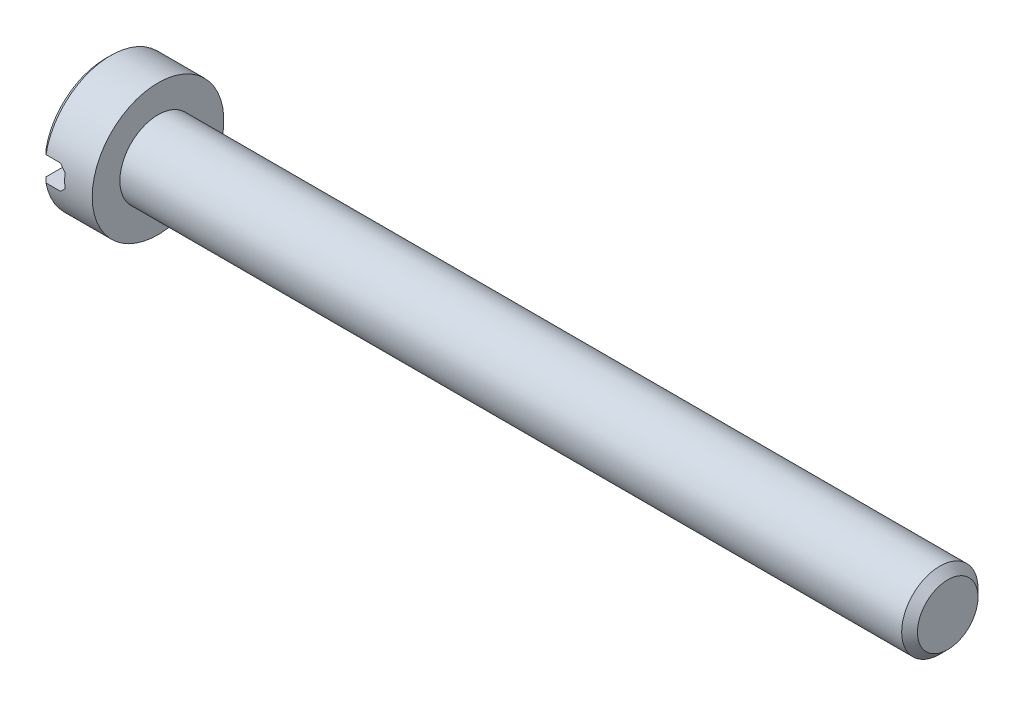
ISO-10303-21;
HEADER;
FILE_DESCRIPTION(('STEP AP214'),'2;1');
FILE_NAME('part.step','',(''),(''),'','','');
FILE_SCHEMA(('AUTOMOTIVE_DESIGN { 1 0 10303 214 1 1 1 1 }'));
ENDSEC;
DATA;
#1=APPLICATION_CONTEXT('core data for automotive mechanical design processes');
#2=APPLICATION_PROTOCOL_DEFINITION('international standard','automotive_design',2000,#1);
#3=PRODUCT_CONTEXT('',#1,'mechanical');
#4=PRODUCT('Part','Part','',(#3));
#5=PRODUCT_RELATED_PRODUCT_CATEGORY('part','',(#4));
#6=PRODUCT_DEFINITION_FORMATION('','',#4);
#7=PRODUCT_DEFINITION_CONTEXT('part definition',#1,'design');
#8=PRODUCT_DEFINITION('design','',#6,#7);
#9=PRODUCT_DEFINITION_SHAPE('','',#8);
#10=(LENGTH_UNIT() NAMED_UNIT(*) SI_UNIT(.MILLI.,.METRE.));
#11=(NAMED_UNIT(*) PLANE_ANGLE_UNIT() SI_UNIT($,.RADIAN.));
#12=(NAMED_UNIT(*) SI_UNIT($,.STERADIAN.) SOLID_ANGLE_UNIT());
#13=UNCERTAINTY_MEASURE_WITH_UNIT(LENGTH_MEASURE(1.E-05),#10,'distance_accuracy_value','');
#14=(GEOMETRIC_REPRESENTATION_CONTEXT(3) GLOBAL_UNCERTAINTY_ASSIGNED_CONTEXT((#13)) GLOBAL_UNIT_ASSIGNED_CONTEXT((#10,
#11,#12)) REPRESENTATION_CONTEXT('',''));
#15=CARTESIAN_POINT('',(0.,0.,0.));
#16=DIRECTION('',(0.,0.,1.));
#17=DIRECTION('',(1.,0.,0.));
#18=AXIS2_PLACEMENT_3D('',#15,#16,#17);
#19=CARTESIAN_POINT('',(2.,2.5,0.));
#20=DIRECTION('',(-1.,0.,0.));
#21=DIRECTION('',(0.,0.,1.));
#22=AXIS2_PLACEMENT_3D('',#19,#20,#21);
#23=PLANE('',#22);
#24=CARTESIAN_POINT('',(2.,0.,0.));
#25=DIRECTION('',(-1.,0.,0.));
#26=DIRECTION('',(0.,0.,1.));
#27=AXIS2_PLACEMENT_3D('',#24,#25,#26);
#28=CIRCLE('',#27,2.5);
#29=CARTESIAN_POINT('',(2.,0.,2.5));
#30=VERTEX_POINT('',#29);
#31=EDGE_CURVE('E195',#30,#30,#28,.T.);
#32=ORIENTED_EDGE('',*,*,#31,.F.);
#33=EDGE_LOOP('',(#32));
#34=FACE_BOUND('',#33,.T.);
#35=CARTESIAN_POINT('',(2.,0.,0.));
#36=DIRECTION('',(-1.,0.,0.));
#37=DIRECTION('',(0.,0.,1.));
#38=AXIS2_PLACEMENT_3D('',#35,#36,#37);
#39=CIRCLE('',#38,1.45);
#40=CARTESIAN_POINT('',(2.,0.,1.45));
#41=VERTEX_POINT('',#40);
#42=EDGE_CURVE('E147',#41,#41,#39,.F.);
#43=ORIENTED_EDGE('',*,*,#42,.F.);
#44=EDGE_LOOP('',(#43));
#45=FACE_BOUND('',#44,.T.);
#46=ADVANCED_FACE('F34',(#34,#45),#23,.F.);
#47=CARTESIAN_POINT('',(0.,0.,0.));
#48=DIRECTION('',(1.,0.,0.));
#49=DIRECTION('',(0.,0.,-1.));
#50=AXIS2_PLACEMENT_3D('',#47,#48,#49);
#51=PLANE('',#50);
#52=CARTESIAN_POINT('',(0.,0.,0.));
#53=DIRECTION('',(-1.,0.,0.));
#54=DIRECTION('',(0.,0.,1.));
#55=AXIS2_PLACEMENT_3D('',#52,#53,#54);
#56=CIRCLE('',#55,2.3);
#57=CARTESIAN_POINT('',(0.,0.465549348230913,2.25239068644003));
#58=VERTEX_POINT('',#57);
#59=CARTESIAN_POINT('',(0.,0.465549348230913,-2.25239068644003));
#60=VERTEX_POINT('',#59);
#61=EDGE_CURVE('E117',#58,#60,#56,.T.);
#62=ORIENTED_EDGE('',*,*,#61,.T.);
#63=DIRECTION('',(0.,0.,1.));
#64=VECTOR('',#63,1.);
#65=CARTESIAN_POINT('',(0.,0.465549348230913,-5.));
#66=LINE('',#65,#64);
#67=EDGE_CURVE('E109',#60,#58,#66,.T.);
#68=ORIENTED_EDGE('',*,*,#67,.T.);
#69=EDGE_LOOP('',(#62,#68));
#70=FACE_BOUND('',#69,.T.);
#71=ADVANCED_FACE('F163',(#70),#51,.F.);
#72=CARTESIAN_POINT('',(0.2,0.,0.));
#73=DIRECTION('',(1.,0.,0.));
#74=DIRECTION('',(0.,0.,-1.));
#75=AXIS2_PLACEMENT_3D('',#72,#73,#74);
#76=CONICAL_SURFACE('',#75,2.5,0.785398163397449);
#77=CARTESIAN_POINT('',(0.2,0.,0.));
#78=DIRECTION('',(-1.,0.,0.));
#79=DIRECTION('',(0.,0.,1.));
#80=AXIS2_PLACEMENT_3D('',#77,#78,#79);
#81=CIRCLE('',#80,2.5);
#82=CARTESIAN_POINT('',(0.2,0.465549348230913,2.45627030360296));
#83=VERTEX_POINT('',#82);
#84=CARTESIAN_POINT('',(0.2,0.465549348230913,-2.45627030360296));
#85=VERTEX_POINT('',#84);
#86=EDGE_CURVE('E118',#83,#85,#81,.T.);
#87=ORIENTED_EDGE('',*,*,#86,.T.);
#88=CARTESIAN_POINT('',(3.20259904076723,0.465549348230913,-5.48286968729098));
#89=CARTESIAN_POINT('',(3.00738145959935,0.465549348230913,-5.28694329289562));
#90=CARTESIAN_POINT('',(2.81219546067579,0.465549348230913,-5.09098538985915));
#91=CARTESIAN_POINT('',(2.42191937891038,0.465549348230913,-4.69895178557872));
#92=CARTESIAN_POINT('',(2.22682930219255,0.465549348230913,-4.50287607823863));
#93=CARTESIAN_POINT('',(1.83653240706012,0.465549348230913,-4.11030517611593));
#94=CARTESIAN_POINT('',(1.64132579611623,0.465549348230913,-3.9138097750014));
#95=CARTESIAN_POINT('',(1.25115924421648,0.465549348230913,-3.52059587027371));
#96=CARTESIAN_POINT('',(1.05619929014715,0.465549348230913,-3.32387737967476));
#97=CARTESIAN_POINT('',(0.678173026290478,0.465549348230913,-2.9416895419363));
#98=CARTESIAN_POINT('',(0.495084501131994,0.465549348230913,-2.7562421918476));
#99=CARTESIAN_POINT('',(0.220902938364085,0.465549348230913,-2.47759625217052));
#100=CARTESIAN_POINT('',(0.129576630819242,0.465549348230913,-2.38462728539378));
#101=CARTESIAN_POINT('',(-0.0528521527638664,0.465549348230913,-2.19847287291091));
#102=CARTESIAN_POINT('',(-0.143954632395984,0.465549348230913,-2.10528743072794));
#103=CARTESIAN_POINT('',(-0.325762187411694,0.465549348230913,-1.91867757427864));
#104=CARTESIAN_POINT('',(-0.416467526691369,0.465549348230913,-1.82525341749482));
#105=CARTESIAN_POINT('',(-0.597381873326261,0.465549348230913,-1.63791440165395));
#106=CARTESIAN_POINT('',(-0.687590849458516,0.465549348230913,-1.54399951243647));
#107=CARTESIAN_POINT('',(-0.867162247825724,0.465549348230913,-1.3554114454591));
#108=CARTESIAN_POINT('',(-0.956524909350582,0.465549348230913,-1.26073849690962));
#109=CARTESIAN_POINT('',(-1.08939468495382,0.465549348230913,-1.11764625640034));
#110=CARTESIAN_POINT('',(-1.1334867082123,0.465549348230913,-1.06977082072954));
#111=CARTESIAN_POINT('',(-1.2210969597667,0.465549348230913,-0.973498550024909));
#112=CARTESIAN_POINT('',(-1.26461520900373,0.465549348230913,-0.925101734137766));
#113=CARTESIAN_POINT('',(-1.3317610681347,0.465549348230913,-0.849065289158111));
#114=CARTESIAN_POINT('',(-1.35569012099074,0.465549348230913,-0.821692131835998));
#115=CARTESIAN_POINT('',(-1.40319102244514,0.465549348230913,-0.766632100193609));
#116=CARTESIAN_POINT('',(-1.42676283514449,0.465549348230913,-0.73894519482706));
#117=CARTESIAN_POINT('',(-1.47366376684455,0.465549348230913,-0.682886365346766));
#118=CARTESIAN_POINT('',(-1.49698800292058,0.465549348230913,-0.654510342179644));
#119=CARTESIAN_POINT('',(-1.54295549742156,0.465549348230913,-0.597221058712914));
#120=CARTESIAN_POINT('',(-1.56559892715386,0.465549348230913,-0.568307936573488));
#121=CARTESIAN_POINT('',(-1.61016736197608,0.465549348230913,-0.509419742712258));
#122=CARTESIAN_POINT('',(-1.63208156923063,0.465549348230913,-0.479436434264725));
#123=CARTESIAN_POINT('',(-1.67445976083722,0.465549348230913,-0.418389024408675));
#124=CARTESIAN_POINT('',(-1.69492180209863,0.465549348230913,-0.387323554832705));
#125=CARTESIAN_POINT('',(-1.73332185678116,0.465549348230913,-0.324061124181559));
#126=CARTESIAN_POINT('',(-1.75128287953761,0.465549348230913,-0.291878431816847));
#127=CARTESIAN_POINT('',(-1.78342369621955,0.465549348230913,-0.225717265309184));
#128=CARTESIAN_POINT('',(-1.79761500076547,0.465549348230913,-0.191744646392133));
#129=CARTESIAN_POINT('',(-1.81895609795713,0.465549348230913,-0.124795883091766));
#130=CARTESIAN_POINT('',(-1.8266128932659,0.465549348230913,-0.0919921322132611));
#131=CARTESIAN_POINT('',(-1.83488894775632,0.465549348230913,-0.0256267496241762));
#132=CARTESIAN_POINT('',(-1.83554895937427,0.465549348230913,0.00792935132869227));
#133=CARTESIAN_POINT('',(-1.82973306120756,0.465549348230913,0.0742464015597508));
#134=CARTESIAN_POINT('',(-1.82328333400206,0.465549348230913,0.107009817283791));
#135=CARTESIAN_POINT('',(-1.80956338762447,0.465549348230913,0.155027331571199));
#136=CARTESIAN_POINT('',(-1.80428518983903,0.465549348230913,0.170909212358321));
#137=CARTESIAN_POINT('',(-1.79261948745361,0.465549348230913,0.202260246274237));
#138=CARTESIAN_POINT('',(-1.78623214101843,0.465549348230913,0.217729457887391));
#139=CARTESIAN_POINT('',(-1.76761840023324,0.465549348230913,0.259328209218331));
#140=CARTESIAN_POINT('',(-1.7545143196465,0.465549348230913,0.285061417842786));
#141=CARTESIAN_POINT('',(-1.72651469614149,0.465549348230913,0.335544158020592));
#142=CARTESIAN_POINT('',(-1.71161720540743,0.465549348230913,0.360292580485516));
#143=CARTESIAN_POINT('',(-1.68054228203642,0.465549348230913,0.409079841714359));
#144=CARTESIAN_POINT('',(-1.66436078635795,0.465549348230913,0.433116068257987));
#145=CARTESIAN_POINT('',(-1.63111775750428,0.465549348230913,0.480575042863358));
#146=CARTESIAN_POINT('',(-1.61405601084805,0.465549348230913,0.503997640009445));
#147=CARTESIAN_POINT('',(-1.5616167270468,0.465549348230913,0.573971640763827));
#148=CARTESIAN_POINT('',(-1.52527399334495,0.465549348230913,0.619796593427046));
#149=CARTESIAN_POINT('',(-1.45124163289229,0.465549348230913,0.710149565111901));
#150=CARTESIAN_POINT('',(-1.41355526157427,0.465549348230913,0.7546802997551));
#151=CARTESIAN_POINT('',(-1.33810033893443,0.465549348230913,0.842013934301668));
#152=CARTESIAN_POINT('',(-1.30035092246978,0.465549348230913,0.884833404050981));
#153=CARTESIAN_POINT('',(-1.22427339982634,0.465549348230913,0.969954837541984));
#154=CARTESIAN_POINT('',(-1.18594527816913,0.465549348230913,1.01225678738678));
#155=CARTESIAN_POINT('',(-1.07035214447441,0.465549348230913,1.13862723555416));
#156=CARTESIAN_POINT('',(-0.992489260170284,0.465549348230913,1.22214795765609));
#157=CARTESIAN_POINT('',(-0.835814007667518,0.465549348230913,1.38847609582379));
#158=CARTESIAN_POINT('',(-0.757000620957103,0.465549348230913,1.47128254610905));
#159=CARTESIAN_POINT('',(-0.598849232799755,0.465549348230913,1.63637982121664));
#160=CARTESIAN_POINT('',(-0.519511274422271,0.465549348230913,1.71867068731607));
#161=CARTESIAN_POINT('',(-0.361217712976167,0.465549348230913,1.88216701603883));
#162=CARTESIAN_POINT('',(-0.282265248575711,0.465549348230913,1.9633755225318));
#163=CARTESIAN_POINT('',(-0.124123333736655,0.465549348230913,2.12556467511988));
#164=CARTESIAN_POINT('',(-0.044933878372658,0.465549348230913,2.20654531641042));
#165=CARTESIAN_POINT('',(0.192811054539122,0.465549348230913,2.44916767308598));
#166=CARTESIAN_POINT('',(0.351615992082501,0.465549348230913,2.61056482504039));
#167=CARTESIAN_POINT('',(0.732972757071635,0.465549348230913,2.99726131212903));
#168=CARTESIAN_POINT('',(0.955700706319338,0.465549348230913,3.22238674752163));
#169=CARTESIAN_POINT('',(1.401572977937,0.465549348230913,3.67230050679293));
#170=CARTESIAN_POINT('',(1.62471736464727,0.465549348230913,3.89708876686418));
#171=CARTESIAN_POINT('',(2.07358635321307,0.465549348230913,4.34881324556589));
#172=CARTESIAN_POINT('',(2.29931333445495,0.465549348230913,4.57574709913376));
#173=CARTESIAN_POINT('',(2.7508805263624,0.465549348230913,5.02942321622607));
#174=CARTESIAN_POINT('',(2.97672071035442,0.465549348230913,5.2561655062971));
#175=CARTESIAN_POINT('',(3.20259904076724,0.465549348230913,5.48286968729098));
#176=B_SPLINE_CURVE_WITH_KNOTS('',3,(#88,#89,#90,#91,#92,#93,#94,#95,#96,#97,#98,#99,#100,#101,
#102,#103,#104,#105,#106,#107,#108,#109,#110,#111,#112,#113,#114,#115,#116,#117,#118,#119,#120,
#121,#122,#123,#124,#125,#126,#127,#128,#129,#130,#131,#132,#133,#134,#135,#136,#137,#138,#139,
#140,#141,#142,#143,#144,#145,#146,#147,#148,#149,#150,#151,#152,#153,#154,#155,#156,#157,#158,
#159,#160,#161,#162,#163,#164,#165,#166,#167,#168,#169,#170,#171,#172,#173,#174,#175),
.UNSPECIFIED.,.F.,.F.,(4,2,2,2,2,2,2,2,2,2,2,2,2,2,2,2,2,2,2,2,2,2,2,2,2,2,2,2,2,2,2,2,2,2,2,2,
2,2,2,2,2,2,2,4),(0.,0.829743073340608,1.65953360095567,2.49046340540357,3.3213470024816,
4.10314469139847,4.49410926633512,4.88506752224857,5.27570632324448,5.66636942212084,
6.05691855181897,6.25217337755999,6.44742105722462,6.55649218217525,6.66557419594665,
6.77576205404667,6.88592195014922,6.99730763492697,7.10883965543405,7.21926609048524,
7.32935136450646,7.42981570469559,7.52969457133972,7.62920684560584,7.67938417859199,
7.72955436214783,7.81607261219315,7.90268569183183,7.9895847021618,8.07650488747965,
8.25190336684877,8.42690244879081,8.59814445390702,8.76939104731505,9.11193368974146,
9.45488345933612,9.79780541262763,10.1375912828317,10.4773842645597,11.1566564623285,
12.1067097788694,13.0569245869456,14.0171665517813,14.9772407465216),.UNSPECIFIED.);
#177=EDGE_CURVE('E57',#85,#60,#176,.T.);
#178=ORIENTED_EDGE('',*,*,#177,.T.);
#179=ORIENTED_EDGE('',*,*,#61,.F.);
#180=EDGE_CURVE('E189',#58,#83,#176,.T.);
#181=ORIENTED_EDGE('',*,*,#180,.T.);
#182=EDGE_LOOP('',(#87,#178,#179,#181));
#183=FACE_BOUND('',#182,.T.);
#184=ADVANCED_FACE('F169',(#183),#76,.T.);
#185=CARTESIAN_POINT('',(0.,-0.465549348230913,-2.25239068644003));
#186=VERTEX_POINT('',#185);
#187=CARTESIAN_POINT('',(0.,-0.465549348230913,2.25239068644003));
#188=VERTEX_POINT('',#187);
#189=EDGE_CURVE('E114',#186,#188,#56,.T.);
#190=ORIENTED_EDGE('',*,*,#189,.T.);
#191=DIRECTION('',(0.,0.,1.));
#192=VECTOR('',#191,1.);
#193=CARTESIAN_POINT('',(0.,-0.465549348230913,-5.));
#194=LINE('',#193,#192);
#195=EDGE_CURVE('E100',#186,#188,#194,.T.);
#196=ORIENTED_EDGE('',*,*,#195,.F.);
#197=EDGE_LOOP('',(#190,#196));
#198=FACE_BOUND('',#197,.T.);
#199=ADVANCED_FACE('F113',(#198),#51,.F.);
#200=CARTESIAN_POINT('',(0.2,-0.465549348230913,-2.45627030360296));
#201=VERTEX_POINT('',#200);
#202=CARTESIAN_POINT('',(0.2,-0.465549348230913,2.45627030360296));
#203=VERTEX_POINT('',#202);
#204=EDGE_CURVE('E122',#201,#203,#81,.T.);
#205=ORIENTED_EDGE('',*,*,#204,.T.);
#206=CARTESIAN_POINT('',(3.20259904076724,-0.465549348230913,5.48286968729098));
#207=CARTESIAN_POINT('',(3.00738145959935,-0.465549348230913,5.28694329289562));
#208=CARTESIAN_POINT('',(2.81219546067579,-0.465549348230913,5.09098538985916));
#209=CARTESIAN_POINT('',(2.42191937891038,-0.465549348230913,4.69895178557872));
#210=CARTESIAN_POINT('',(2.22682930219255,-0.465549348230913,4.50287607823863));
#211=CARTESIAN_POINT('',(1.83653240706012,-0.465549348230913,4.11030517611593));
#212=CARTESIAN_POINT('',(1.64132579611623,-0.465549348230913,3.9138097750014));
#213=CARTESIAN_POINT('',(1.25115924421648,-0.465549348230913,3.52059587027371));
#214=CARTESIAN_POINT('',(1.05619929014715,-0.465549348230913,3.32387737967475));
#215=CARTESIAN_POINT('',(0.678173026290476,-0.465549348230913,2.9416895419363));
#216=CARTESIAN_POINT('',(0.495084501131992,-0.465549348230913,2.75624219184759));
#217=CARTESIAN_POINT('',(0.220902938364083,-0.465549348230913,2.47759625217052));
#218=CARTESIAN_POINT('',(0.12957663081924,-0.465549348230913,2.38462728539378));
#219=CARTESIAN_POINT('',(-0.0528521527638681,-0.465549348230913,2.19847287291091));
#220=CARTESIAN_POINT('',(-0.143954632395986,-0.465549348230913,2.10528743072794));
#221=CARTESIAN_POINT('',(-0.325762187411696,-0.465549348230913,1.91867757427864));
#222=CARTESIAN_POINT('',(-0.41646752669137,-0.465549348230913,1.82525341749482));
#223=CARTESIAN_POINT('',(-0.597381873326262,-0.465549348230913,1.63791440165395));
#224=CARTESIAN_POINT('',(-0.687590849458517,-0.465549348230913,1.54399951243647));
#225=CARTESIAN_POINT('',(-0.867162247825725,-0.465549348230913,1.3554114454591));
#226=CARTESIAN_POINT('',(-0.956524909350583,-0.465549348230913,1.26073849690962));
#227=CARTESIAN_POINT('',(-1.08939468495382,-0.465549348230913,1.11764625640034));
#228=CARTESIAN_POINT('',(-1.1334867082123,-0.465549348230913,1.06977082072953));
#229=CARTESIAN_POINT('',(-1.2210969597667,-0.465549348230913,0.973498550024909));
#230=CARTESIAN_POINT('',(-1.26461520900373,-0.465549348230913,0.925101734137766));
#231=CARTESIAN_POINT('',(-1.33176106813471,-0.465549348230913,0.84906528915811));
#232=CARTESIAN_POINT('',(-1.35569012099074,-0.465549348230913,0.821692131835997));
#233=CARTESIAN_POINT('',(-1.40319102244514,-0.465549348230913,0.766632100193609));
#234=CARTESIAN_POINT('',(-1.42676283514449,-0.465549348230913,0.738945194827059));
#235=CARTESIAN_POINT('',(-1.47366376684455,-0.465549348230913,0.682886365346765));
#236=CARTESIAN_POINT('',(-1.49698800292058,-0.465549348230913,0.654510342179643));
#237=CARTESIAN_POINT('',(-1.54295549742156,-0.465549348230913,0.597221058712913));
#238=CARTESIAN_POINT('',(-1.56559892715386,-0.465549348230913,0.568307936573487));
#239=CARTESIAN_POINT('',(-1.61016736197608,-0.465549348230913,0.509419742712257));
#240=CARTESIAN_POINT('',(-1.63208156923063,-0.465549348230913,0.479436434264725));
#241=CARTESIAN_POINT('',(-1.67445976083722,-0.465549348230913,0.418389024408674));
#242=CARTESIAN_POINT('',(-1.69492180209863,-0.465549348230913,0.387323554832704));
#243=CARTESIAN_POINT('',(-1.73332185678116,-0.465549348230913,0.324061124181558));
#244=CARTESIAN_POINT('',(-1.75128287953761,-0.465549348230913,0.291878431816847));
#245=CARTESIAN_POINT('',(-1.78342369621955,-0.465549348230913,0.225717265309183));
#246=CARTESIAN_POINT('',(-1.79761500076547,-0.465549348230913,0.191744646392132));
#247=CARTESIAN_POINT('',(-1.81895609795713,-0.465549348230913,0.124795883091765));
#248=CARTESIAN_POINT('',(-1.8266128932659,-0.465549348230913,0.0919921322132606));
#249=CARTESIAN_POINT('',(-1.83488894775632,-0.465549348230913,0.0256267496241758));
#250=CARTESIAN_POINT('',(-1.83554895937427,-0.465549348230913,-0.00792935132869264));
#251=CARTESIAN_POINT('',(-1.82973306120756,-0.465549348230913,-0.0742464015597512));
#252=CARTESIAN_POINT('',(-1.82328333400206,-0.465549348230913,-0.107009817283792));
#253=CARTESIAN_POINT('',(-1.80956338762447,-0.465549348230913,-0.155027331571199));
#254=CARTESIAN_POINT('',(-1.80428518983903,-0.465549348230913,-0.170909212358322));
#255=CARTESIAN_POINT('',(-1.79261948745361,-0.465549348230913,-0.202260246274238));
#256=CARTESIAN_POINT('',(-1.78623214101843,-0.465549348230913,-0.217729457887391));
#257=CARTESIAN_POINT('',(-1.76761840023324,-0.465549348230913,-0.259328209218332));
#258=CARTESIAN_POINT('',(-1.7545143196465,-0.465549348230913,-0.285061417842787));
#259=CARTESIAN_POINT('',(-1.72651469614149,-0.465549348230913,-0.335544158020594));
#260=CARTESIAN_POINT('',(-1.71161720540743,-0.465549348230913,-0.360292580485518));
#261=CARTESIAN_POINT('',(-1.68054228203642,-0.465549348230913,-0.40907984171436));
#262=CARTESIAN_POINT('',(-1.66436078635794,-0.465549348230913,-0.433116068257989));
#263=CARTESIAN_POINT('',(-1.63111775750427,-0.465549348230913,-0.48057504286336));
#264=CARTESIAN_POINT('',(-1.61405601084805,-0.465549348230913,-0.503997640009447));
#265=CARTESIAN_POINT('',(-1.5616167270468,-0.465549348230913,-0.573971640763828));
#266=CARTESIAN_POINT('',(-1.52527399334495,-0.465549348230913,-0.619796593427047));
#267=CARTESIAN_POINT('',(-1.45124163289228,-0.465549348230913,-0.710149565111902));
#268=CARTESIAN_POINT('',(-1.41355526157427,-0.465549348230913,-0.754680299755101));
#269=CARTESIAN_POINT('',(-1.33810033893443,-0.465549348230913,-0.842013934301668));
#270=CARTESIAN_POINT('',(-1.30035092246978,-0.465549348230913,-0.88483340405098));
#271=CARTESIAN_POINT('',(-1.22427339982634,-0.465549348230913,-0.969954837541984));
#272=CARTESIAN_POINT('',(-1.18594527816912,-0.465549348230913,-1.01225678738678));
#273=CARTESIAN_POINT('',(-1.07035214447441,-0.465549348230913,-1.13862723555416));
#274=CARTESIAN_POINT('',(-0.992489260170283,-0.465549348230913,-1.2221479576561));
#275=CARTESIAN_POINT('',(-0.835814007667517,-0.465549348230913,-1.38847609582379));
#276=CARTESIAN_POINT('',(-0.757000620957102,-0.465549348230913,-1.47128254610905));
#277=CARTESIAN_POINT('',(-0.598849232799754,-0.465549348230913,-1.63637982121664));
#278=CARTESIAN_POINT('',(-0.51951127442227,-0.465549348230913,-1.71867068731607));
#279=CARTESIAN_POINT('',(-0.361217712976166,-0.465549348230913,-1.88216701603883));
#280=CARTESIAN_POINT('',(-0.282265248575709,-0.465549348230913,-1.9633755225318));
#281=CARTESIAN_POINT('',(-0.124123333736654,-0.465549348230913,-2.12556467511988));
#282=CARTESIAN_POINT('',(-0.0449338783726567,-0.465549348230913,-2.20654531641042));
#283=CARTESIAN_POINT('',(0.192811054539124,-0.465549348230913,-2.44916767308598));
#284=CARTESIAN_POINT('',(0.351615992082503,-0.465549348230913,-2.6105648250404));
#285=CARTESIAN_POINT('',(0.732972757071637,-0.465549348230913,-2.99726131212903));
#286=CARTESIAN_POINT('',(0.95570070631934,-0.465549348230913,-3.22238674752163));
#287=CARTESIAN_POINT('',(1.401572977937,-0.465549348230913,-3.67230050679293));
#288=CARTESIAN_POINT('',(1.62471736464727,-0.465549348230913,-3.89708876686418));
#289=CARTESIAN_POINT('',(2.07358635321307,-0.465549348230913,-4.34881324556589));
#290=CARTESIAN_POINT('',(2.29931333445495,-0.465549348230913,-4.57574709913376));
#291=CARTESIAN_POINT('',(2.75088052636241,-0.465549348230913,-5.02942321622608));
#292=CARTESIAN_POINT('',(2.97672071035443,-0.465549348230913,-5.2561655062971));
#293=CARTESIAN_POINT('',(3.20259904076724,-0.465549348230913,-5.48286968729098));
#294=B_SPLINE_CURVE_WITH_KNOTS('',3,(#206,#207,#208,#209,#210,#211,#212,#213,#214,#215,#216,
#217,#218,#219,#220,#221,#222,#223,#224,#225,#226,#227,#228,#229,#230,#231,#232,#233,#234,#235,
#236,#237,#238,#239,#240,#241,#242,#243,#244,#245,#246,#247,#248,#249,#250,#251,#252,#253,#254,
#255,#256,#257,#258,#259,#260,#261,#262,#263,#264,#265,#266,#267,#268,#269,#270,#271,#272,#273,
#274,#275,#276,#277,#278,#279,#280,#281,#282,#283,#284,#285,#286,#287,#288,#289,#290,#291,#292,
#293),.UNSPECIFIED.,.F.,.F.,(4,2,2,2,2,2,2,2,2,2,2,2,2,2,2,2,2,2,2,2,2,2,2,2,2,2,2,2,2,2,2,2,2,
2,2,2,2,2,2,2,2,2,2,4),(0.,0.82974307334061,1.65953360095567,2.49046340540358,3.32134700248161,
4.10314469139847,4.49410926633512,4.88506752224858,5.27570632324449,5.66636942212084,
6.05691855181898,6.25217337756,6.44742105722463,6.55649218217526,6.66557419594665,
6.77576205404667,6.88592195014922,6.99730763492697,7.10883965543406,7.21926609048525,
7.32935136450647,7.42981570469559,7.52969457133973,7.62920684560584,7.67938417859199,
7.72955436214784,7.81607261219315,7.90268569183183,7.98958470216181,8.07650488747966,
8.25190336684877,8.42690244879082,8.59814445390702,8.76939104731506,9.11193368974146,
9.45488345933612,9.79780541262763,10.1375912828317,10.4773842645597,11.1566564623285,
12.1067097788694,13.0569245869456,14.0171665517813,14.9772407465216),.UNSPECIFIED.);
#295=EDGE_CURVE('E108',#203,#188,#294,.T.);
#296=ORIENTED_EDGE('',*,*,#295,.T.);
#297=ORIENTED_EDGE('',*,*,#189,.F.);
#298=EDGE_CURVE('E97',#186,#201,#294,.T.);
#299=ORIENTED_EDGE('',*,*,#298,.T.);
#300=EDGE_LOOP('',(#205,#296,#297,#299));
#301=FACE_BOUND('',#300,.T.);
#302=ADVANCED_FACE('F116',(#301),#76,.T.);
#303=CARTESIAN_POINT('',(0.,0.,0.));
#304=DIRECTION('',(-1.,0.,0.));
#305=DIRECTION('',(0.,0.,1.));
#306=AXIS2_PLACEMENT_3D('',#303,#304,#305);
#307=CYLINDRICAL_SURFACE('',#306,2.5);
#308=ORIENTED_EDGE('',*,*,#86,.F.);
#309=DIRECTION('',(-1.,0.,0.));
#310=VECTOR('',#309,1.);
#311=CARTESIAN_POINT('',(0.,0.465549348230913,2.45627030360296));
#312=LINE('',#311,#310);
#313=CARTESIAN_POINT('',(0.753445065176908,0.465549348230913,2.45627030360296));
#314=VERTEX_POINT('',#313);
#315=EDGE_CURVE('E144',#83,#314,#312,.F.);
#316=ORIENTED_EDGE('',*,*,#315,.T.);
#317=CARTESIAN_POINT('',(1.21899441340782,0.,0.));
#318=DIRECTION('',(0.707106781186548,0.707106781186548,0.));
#319=DIRECTION('',(-0.707106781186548,0.707106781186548,0.));
#320=AXIS2_PLACEMENT_3D('',#317,#318,#319);
#321=ELLIPSE('',#320,3.53553390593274,2.5);
#322=CARTESIAN_POINT('',(0.953445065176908,0.265549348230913,2.48585670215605));
#323=VERTEX_POINT('',#322);
#324=EDGE_CURVE('E139',#314,#323,#321,.T.);
#325=ORIENTED_EDGE('',*,*,#324,.T.);
#326=CARTESIAN_POINT('',(0.953445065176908,0.,0.));
#327=DIRECTION('',(1.,0.,0.));
#328=DIRECTION('',(0.,0.,-1.));
#329=AXIS2_PLACEMENT_3D('',#326,#327,#328);
#330=CIRCLE('',#329,2.5);
#331=CARTESIAN_POINT('',(0.953445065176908,-0.265549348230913,2.48585670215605));
#332=VERTEX_POINT('',#331);
#333=EDGE_CURVE('E135',#323,#332,#330,.T.);
#334=ORIENTED_EDGE('',*,*,#333,.T.);
#335=CARTESIAN_POINT('',(1.21899441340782,0.,0.));
#336=DIRECTION('',(0.707106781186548,-0.707106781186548,0.));
#337=DIRECTION('',(-0.707106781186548,-0.707106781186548,0.));
#338=AXIS2_PLACEMENT_3D('',#335,#336,#337);
#339=ELLIPSE('',#338,3.53553390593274,2.5);
#340=CARTESIAN_POINT('',(0.753445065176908,-0.465549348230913,2.45627030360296));
#341=VERTEX_POINT('',#340);
#342=EDGE_CURVE('E131',#332,#341,#339,.T.);
#343=ORIENTED_EDGE('',*,*,#342,.T.);
#344=DIRECTION('',(-1.,0.,0.));
#345=VECTOR('',#344,1.);
#346=CARTESIAN_POINT('',(0.,-0.465549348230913,2.45627030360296));
#347=LINE('',#346,#345);
#348=EDGE_CURVE('E141',#341,#203,#347,.T.);
#349=ORIENTED_EDGE('',*,*,#348,.T.);
#350=ORIENTED_EDGE('',*,*,#204,.F.);
#351=DIRECTION('',(-1.,0.,0.));
#352=VECTOR('',#351,1.);
#353=CARTESIAN_POINT('',(0.,-0.465549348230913,-2.45627030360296));
#354=LINE('',#353,#352);
#355=CARTESIAN_POINT('',(0.753445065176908,-0.465549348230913,-2.45627030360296));
#356=VERTEX_POINT('',#355);
#357=EDGE_CURVE('E103',#201,#356,#354,.F.);
#358=ORIENTED_EDGE('',*,*,#357,.T.);
#359=CARTESIAN_POINT('',(0.953445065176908,-0.265549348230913,-2.48585670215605));
#360=VERTEX_POINT('',#359);
#361=EDGE_CURVE('E127',#356,#360,#339,.T.);
#362=ORIENTED_EDGE('',*,*,#361,.T.);
#363=CARTESIAN_POINT('',(0.953445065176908,0.265549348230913,-2.48585670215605));
#364=VERTEX_POINT('',#363);
#365=EDGE_CURVE('E130',#360,#364,#330,.T.);
#366=ORIENTED_EDGE('',*,*,#365,.T.);
#367=CARTESIAN_POINT('',(0.753445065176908,0.465549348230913,-2.45627030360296));
#368=VERTEX_POINT('',#367);
#369=EDGE_CURVE('E134',#364,#368,#321,.T.);
#370=ORIENTED_EDGE('',*,*,#369,.T.);
#371=DIRECTION('',(-1.,0.,0.));
#372=VECTOR('',#371,1.);
#373=CARTESIAN_POINT('',(0.,0.465549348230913,-2.45627030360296));
#374=LINE('',#373,#372);
#375=EDGE_CURVE('E138',#368,#85,#374,.T.);
#376=ORIENTED_EDGE('',*,*,#375,.T.);
#377=EDGE_LOOP('',(#308,#316,#325,#334,#343,#349,#350,#358,#362,#366,#370,#376));
#378=FACE_BOUND('',#377,.T.);
#379=ORIENTED_EDGE('',*,*,#31,.T.);
#380=EDGE_LOOP('',(#379));
#381=FACE_BOUND('',#380,.T.);
#382=ADVANCED_FACE('F177',(#378,#381),#307,.T.);
#383=CARTESIAN_POINT('',(0.,0.465549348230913,-5.));
#384=DIRECTION('',(0.,1.,0.));
#385=DIRECTION('',(0.,0.,1.));
#386=AXIS2_PLACEMENT_3D('',#383,#384,#385);
#387=PLANE('',#386);
#388=ORIENTED_EDGE('',*,*,#375,.F.);
#389=DIRECTION('',(0.,0.,1.));
#390=VECTOR('',#389,1.);
#391=CARTESIAN_POINT('',(0.753445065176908,0.465549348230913,-5.));
#392=LINE('',#391,#390);
#393=EDGE_CURVE('E225',#368,#314,#392,.T.);
#394=ORIENTED_EDGE('',*,*,#393,.T.);
#395=ORIENTED_EDGE('',*,*,#315,.F.);
#396=ORIENTED_EDGE('',*,*,#180,.F.);
#397=ORIENTED_EDGE('',*,*,#67,.F.);
#398=ORIENTED_EDGE('',*,*,#177,.F.);
#399=EDGE_LOOP('',(#388,#394,#395,#396,#397,#398));
#400=FACE_BOUND('',#399,.T.);
#401=ADVANCED_FACE('F180',(#400),#387,.F.);
#402=CARTESIAN_POINT('',(0.753445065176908,0.465549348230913,-5.));
#403=DIRECTION('',(0.707106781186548,0.707106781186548,0.));
#404=DIRECTION('',(-0.707106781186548,0.707106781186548,0.));
#405=AXIS2_PLACEMENT_3D('',#402,#403,#404);
#406=PLANE('',#405);
#407=ORIENTED_EDGE('',*,*,#393,.F.);
#408=ORIENTED_EDGE('',*,*,#369,.F.);
#409=DIRECTION('',(0.,0.,1.));
#410=VECTOR('',#409,1.);
#411=CARTESIAN_POINT('',(0.953445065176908,0.265549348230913,-5.));
#412=LINE('',#411,#410);
#413=EDGE_CURVE('E227',#364,#323,#412,.T.);
#414=ORIENTED_EDGE('',*,*,#413,.T.);
#415=ORIENTED_EDGE('',*,*,#324,.F.);
#416=EDGE_LOOP('',(#407,#408,#414,#415));
#417=FACE_BOUND('',#416,.T.);
#418=ADVANCED_FACE('F200',(#417),#406,.F.);
#419=CARTESIAN_POINT('',(0.953445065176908,0.265549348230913,-5.));
#420=DIRECTION('',(1.,0.,0.));
#421=DIRECTION('',(0.,0.,-1.));
#422=AXIS2_PLACEMENT_3D('',#419,#420,#421);
#423=PLANE('',#422);
#424=ORIENTED_EDGE('',*,*,#413,.F.);
#425=ORIENTED_EDGE('',*,*,#365,.F.);
#426=DIRECTION('',(0.,0.,1.));
#427=VECTOR('',#426,1.);
#428=CARTESIAN_POINT('',(0.953445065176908,-0.265549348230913,-5.));
#429=LINE('',#428,#427);
#430=EDGE_CURVE('E216',#360,#332,#429,.T.);
#431=ORIENTED_EDGE('',*,*,#430,.T.);
#432=ORIENTED_EDGE('',*,*,#333,.F.);
#433=EDGE_LOOP('',(#424,#425,#431,#432));
#434=FACE_BOUND('',#433,.T.);
#435=ADVANCED_FACE('F203',(#434),#423,.F.);
#436=CARTESIAN_POINT('',(0.753445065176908,-0.465549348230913,-5.));
#437=DIRECTION('',(0.707106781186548,-0.707106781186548,0.));
#438=DIRECTION('',(0.707106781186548,0.707106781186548,0.));
#439=AXIS2_PLACEMENT_3D('',#436,#437,#438);
#440=PLANE('',#439);
#441=DIRECTION('',(0.,0.,1.));
#442=VECTOR('',#441,1.);
#443=CARTESIAN_POINT('',(0.753445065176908,-0.465549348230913,-5.));
#444=LINE('',#443,#442);
#445=EDGE_CURVE('E49',#356,#341,#444,.T.);
#446=ORIENTED_EDGE('',*,*,#445,.T.);
#447=ORIENTED_EDGE('',*,*,#342,.F.);
#448=ORIENTED_EDGE('',*,*,#430,.F.);
#449=ORIENTED_EDGE('',*,*,#361,.F.);
#450=EDGE_LOOP('',(#446,#447,#448,#449));
#451=FACE_BOUND('',#450,.T.);
#452=ADVANCED_FACE('F206',(#451),#440,.F.);
#453=CARTESIAN_POINT('',(0.,-0.465549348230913,-5.));
#454=DIRECTION('',(0.,-1.,0.));
#455=DIRECTION('',(0.,0.,-1.));
#456=AXIS2_PLACEMENT_3D('',#453,#454,#455);
#457=PLANE('',#456);
#458=ORIENTED_EDGE('',*,*,#348,.F.);
#459=ORIENTED_EDGE('',*,*,#445,.F.);
#460=ORIENTED_EDGE('',*,*,#357,.F.);
#461=ORIENTED_EDGE('',*,*,#298,.F.);
#462=ORIENTED_EDGE('',*,*,#195,.T.);
#463=ORIENTED_EDGE('',*,*,#295,.F.);
#464=EDGE_LOOP('',(#458,#459,#460,#461,#462,#463));
#465=FACE_BOUND('',#464,.T.);
#466=ADVANCED_FACE('F99',(#465),#457,.F.);
#467=CARTESIAN_POINT('',(32.,0.,0.));
#468=DIRECTION('',(-1.,0.,0.));
#469=DIRECTION('',(0.,0.,1.));
#470=AXIS2_PLACEMENT_3D('',#467,#468,#469);
#471=CYLINDRICAL_SURFACE('',#470,1.45);
#472=CARTESIAN_POINT('',(31.7,0.,0.));
#473=DIRECTION('',(1.,0.,0.));
#474=DIRECTION('',(0.,0.,-1.));
#475=AXIS2_PLACEMENT_3D('',#472,#473,#474);
#476=CIRCLE('',#475,1.45);
#477=CARTESIAN_POINT('',(31.7,0.,-1.45));
#478=VERTEX_POINT('',#477);
#479=EDGE_CURVE('E11',#478,#478,#476,.F.);
#480=ORIENTED_EDGE('',*,*,#479,.T.);
#481=EDGE_LOOP('',(#480));
#482=FACE_BOUND('',#481,.T.);
#483=ORIENTED_EDGE('',*,*,#42,.T.);
#484=EDGE_LOOP('',(#483));
#485=FACE_BOUND('',#484,.T.);
#486=ADVANCED_FACE('F159',(#482,#485),#471,.T.);
#487=CARTESIAN_POINT('',(32.,0.,0.));
#488=DIRECTION('',(1.,0.,0.));
#489=DIRECTION('',(0.,0.,-1.));
#490=AXIS2_PLACEMENT_3D('',#487,#488,#489);
#491=PLANE('',#490);
#492=CARTESIAN_POINT('',(32.,0.,0.));
#493=DIRECTION('',(1.,0.,0.));
#494=DIRECTION('',(0.,0.,-1.));
#495=AXIS2_PLACEMENT_3D('',#492,#493,#494);
#496=CIRCLE('',#495,1.14999999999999);
#497=CARTESIAN_POINT('',(32.,0.,-1.14999999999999));
#498=VERTEX_POINT('',#497);
#499=EDGE_CURVE('E42',#498,#498,#496,.T.);
#500=ORIENTED_EDGE('',*,*,#499,.T.);
#501=EDGE_LOOP('',(#500));
#502=FACE_BOUND('',#501,.T.);
#503=ADVANCED_FACE('F152',(#502),#491,.T.);
#504=CARTESIAN_POINT('',(32.,0.,0.));
#505=DIRECTION('',(-1.,0.,0.));
#506=DIRECTION('',(0.,0.,1.));
#507=AXIS2_PLACEMENT_3D('',#504,#505,#506);
#508=CONICAL_SURFACE('',#507,1.14999999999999,0.785398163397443);
#509=ORIENTED_EDGE('',*,*,#479,.F.);
#510=EDGE_LOOP('',(#509));
#511=FACE_BOUND('',#510,.T.);
#512=ORIENTED_EDGE('',*,*,#499,.F.);
#513=EDGE_LOOP('',(#512));
#514=FACE_BOUND('',#513,.T.);
#515=ADVANCED_FACE('F36',(#511,#514),#508,.T.);
#516=CLOSED_SHELL('',(#46,#71,#184,#199,#302,#382,#401,#418,#435,#452,#466,#486,#503,#515));
#517=MANIFOLD_SOLID_BREP('B2',#516);
#518=ADVANCED_BREP_SHAPE_REPRESENTATION('',(#18,#517),#14);
#519=SHAPE_DEFINITION_REPRESENTATION(#9,#518);
ENDSEC;
END-ISO-10303-21;
